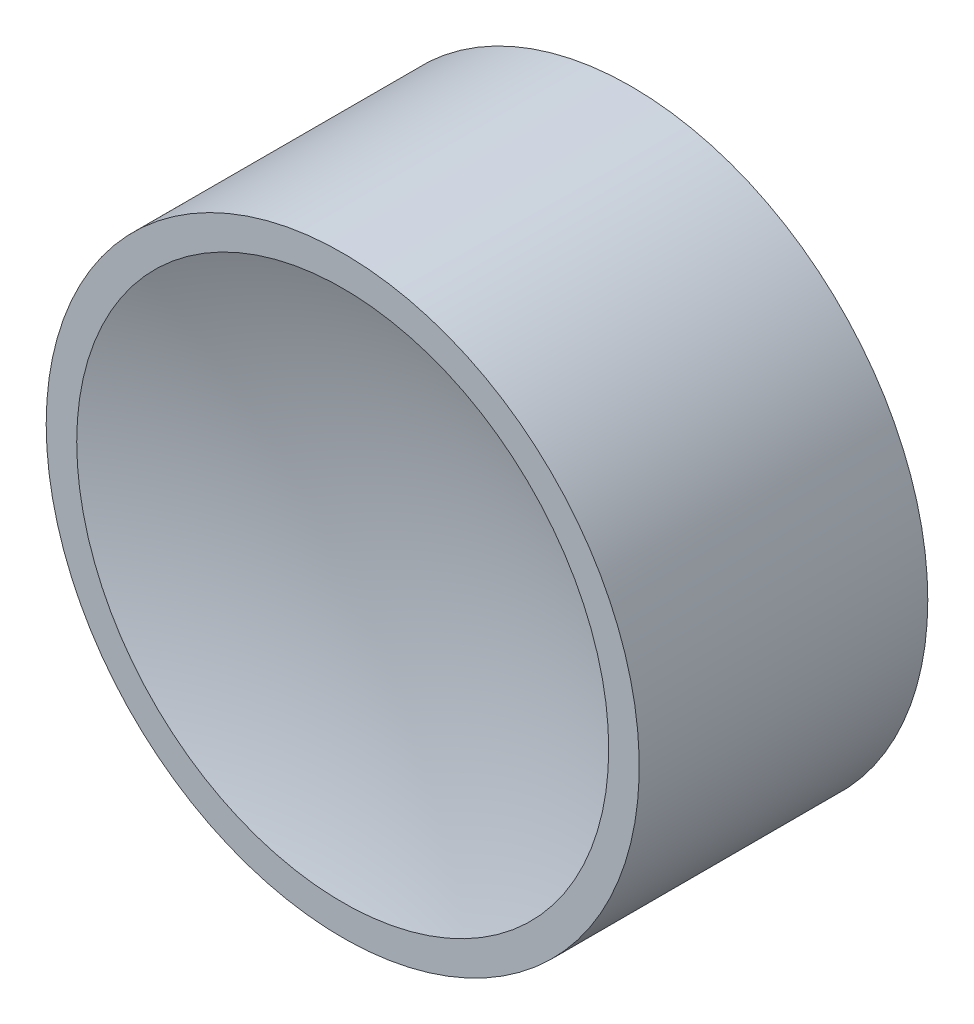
ISO-10303-21;
HEADER;
FILE_DESCRIPTION(('STEP AP214'),'2;1');
FILE_NAME('part.step','',(''),(''),'','','');
FILE_SCHEMA(('AUTOMOTIVE_DESIGN { 1 0 10303 214 1 1 1 1 }'));
ENDSEC;
DATA;
#1=APPLICATION_CONTEXT('core data for automotive mechanical design processes');
#2=APPLICATION_PROTOCOL_DEFINITION('international standard','automotive_design',2000,#1);
#3=PRODUCT_CONTEXT('',#1,'mechanical');
#4=PRODUCT('Part','Part','',(#3));
#5=PRODUCT_RELATED_PRODUCT_CATEGORY('part','',(#4));
#6=PRODUCT_DEFINITION_FORMATION('','',#4);
#7=PRODUCT_DEFINITION_CONTEXT('part definition',#1,'design');
#8=PRODUCT_DEFINITION('design','',#6,#7);
#9=PRODUCT_DEFINITION_SHAPE('','',#8);
#10=(LENGTH_UNIT() NAMED_UNIT(*) SI_UNIT(.MILLI.,.METRE.));
#11=(NAMED_UNIT(*) PLANE_ANGLE_UNIT() SI_UNIT($,.RADIAN.));
#12=(NAMED_UNIT(*) SI_UNIT($,.STERADIAN.) SOLID_ANGLE_UNIT());
#13=UNCERTAINTY_MEASURE_WITH_UNIT(LENGTH_MEASURE(1.E-05),#10,'distance_accuracy_value','');
#14=(GEOMETRIC_REPRESENTATION_CONTEXT(3) GLOBAL_UNCERTAINTY_ASSIGNED_CONTEXT((#13)) GLOBAL_UNIT_ASSIGNED_CONTEXT((#10,
#11,#12)) REPRESENTATION_CONTEXT('',''));
#15=CARTESIAN_POINT('',(0.,0.,0.));
#16=DIRECTION('',(0.,0.,1.));
#17=DIRECTION('',(1.,0.,0.));
#18=AXIS2_PLACEMENT_3D('',#15,#16,#17);
#19=CARTESIAN_POINT('',(0.,0.,17.217));
#20=DIRECTION('',(0.,0.,-1.));
#21=DIRECTION('',(-1.,0.,0.));
#22=AXIS2_PLACEMENT_3D('',#19,#20,#21);
#23=CYLINDRICAL_SURFACE('',#22,17.);
#24=CARTESIAN_POINT('',(0.,0.,16.5441495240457));
#25=DIRECTION('',(0.,0.,-1.));
#26=DIRECTION('',(-1.,0.,0.));
#27=AXIS2_PLACEMENT_3D('',#24,#25,#26);
#28=CIRCLE('',#27,17.);
#29=CARTESIAN_POINT('',(-17.,0.,16.5441495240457));
#30=VERTEX_POINT('',#29);
#31=EDGE_CURVE('E42',#30,#30,#28,.T.);
#32=ORIENTED_EDGE('',*,*,#31,.T.);
#33=EDGE_LOOP('',(#32));
#34=FACE_BOUND('',#33,.T.);
#35=CARTESIAN_POINT('',(0.,0.,0.));
#36=DIRECTION('',(0.,0.,1.));
#37=DIRECTION('',(1.,0.,0.));
#38=AXIS2_PLACEMENT_3D('',#35,#36,#37);
#39=CIRCLE('',#38,17.);
#40=CARTESIAN_POINT('',(17.,0.,0.));
#41=VERTEX_POINT('',#40);
#42=EDGE_CURVE('E10',#41,#41,#39,.T.);
#43=ORIENTED_EDGE('',*,*,#42,.T.);
#44=EDGE_LOOP('',(#43));
#45=FACE_BOUND('',#44,.T.);
#46=ADVANCED_FACE('F36',(#34,#45),#23,.T.);
#47=CARTESIAN_POINT('',(0.,0.,61.415597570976));
#48=DIRECTION('',(0.,0.,1.));
#49=DIRECTION('',(1.,0.,0.));
#50=AXIS2_PLACEMENT_3D('',#47,#48,#49);
#51=SPHERICAL_SURFACE('',#50,63.7250000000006);
#52=ORIENTED_EDGE('',*,*,#42,.F.);
#53=EDGE_LOOP('',(#52));
#54=FACE_BOUND('',#53,.T.);
#55=ADVANCED_FACE('F61',(#54),#51,.T.);
#56=CARTESIAN_POINT('',(-17.,0.,16.5441495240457));
#57=DIRECTION('',(0.,0.,-1.));
#58=DIRECTION('',(-1.,0.,0.));
#59=AXIS2_PLACEMENT_3D('',#56,#57,#58);
#60=PLANE('',#59);
#61=ORIENTED_EDGE('',*,*,#31,.F.);
#62=EDGE_LOOP('',(#61));
#63=FACE_BOUND('',#62,.T.);
#64=CARTESIAN_POINT('',(0.,0.,16.5441495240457));
#65=DIRECTION('',(0.,0.,-1.));
#66=DIRECTION('',(-1.,0.,0.));
#67=AXIS2_PLACEMENT_3D('',#64,#65,#66);
#68=CIRCLE('',#67,15.25);
#69=CARTESIAN_POINT('',(-15.25,0.,16.5441495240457));
#70=VERTEX_POINT('',#69);
#71=EDGE_CURVE('E46',#70,#70,#68,.T.);
#72=ORIENTED_EDGE('',*,*,#71,.T.);
#73=EDGE_LOOP('',(#72));
#74=FACE_BOUND('',#73,.T.);
#75=ADVANCED_FACE('F53',(#63,#74),#60,.F.);
#76=CARTESIAN_POINT('',(0.,0.,58.8196845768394));
#77=DIRECTION('',(0.,0.,1.));
#78=DIRECTION('',(1.,0.,0.));
#79=AXIS2_PLACEMENT_3D('',#76,#77,#78);
#80=SPHERICAL_SURFACE('',#79,44.9419999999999);
#81=ORIENTED_EDGE('',*,*,#71,.F.);
#82=EDGE_LOOP('',(#81));
#83=FACE_BOUND('',#82,.T.);
#84=ADVANCED_FACE('F55',(#83),#80,.F.);
#85=CLOSED_SHELL('',(#46,#55,#75,#84));
#86=MANIFOLD_SOLID_BREP('B2',#85);
#87=ADVANCED_BREP_SHAPE_REPRESENTATION('',(#18,#86),#14);
#88=SHAPE_DEFINITION_REPRESENTATION(#9,#87);
ENDSEC;
END-ISO-10303-21;
